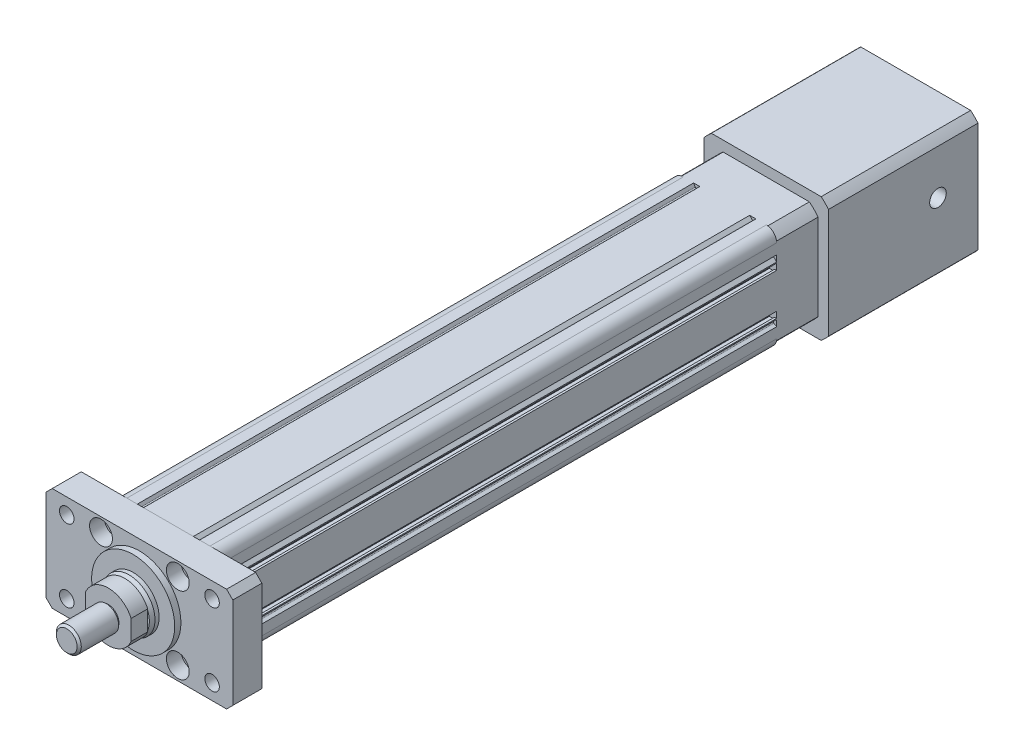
from build123d import *

# Parameters (mm, degrees)
SKETCH_1_R                  = 20
SKETCH_1_R_2                = 2.75
EXTRUDE_1_DEPTH             = 268
FILLET_1_R                  = 5
EXTRUDE_2_DEPTH             = 14
SKETCH_3_R                  = 20
EXTRUDE_3_DEPTH             = 3
SKETCH_5_R                  = 12.5
EXTRUDE_4_DEPTH             = 4
CHAMFER_1_SIZE              = 2
CHAMFER_1_SIZE2             = 0.7
EXTRUDE_5_DEPTH             = 8
SKETCH_7_R                  = 5.15
EXTRUDE_6_DEPTH             = 1
SKETCH_8_R                  = 6
EXTRUDE_7_DEPTH             = 19
CHAMFER_2_SIZE              = 1
SKETCH_23_W                 = 50
SKETCH_23_H                 = 50
EXTRUDE_8_DEPTH             = 20
SKETCH_24_R                 = 42.5
SKETCH_24_R_2               = 32.5
CUT_EXTRUDE_1_DEPTH         = 20
SKETCH_28_W                 = 60
SKETCH_28_H                 = 60
EXTRUDE_9_DEPTH             = 72
SKETCH_4_R                  = 3.5
CUT_EXTRUDE_5_DEPTH         = 30
SKETCH_4_6_R                = 5.5
CUT_EXTRUDE_6_DEPTH         = 7
CUT_EXTRUDE_START           = -72
SKETCH_30_R                 = 3.5
CUT_EXTRUDE_7_DEPTH         = 72
SKETCH_30_4_R               = 5.5
CUT_EXTRUDE_8_DEPTH         = 50
HOLE_WIZARD_M5_1_AT_2_COUNT = 2
HOLE_WIZARD_M5_1_AT_2_PITCH = 49.497474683
HOLE_WIZARD_M5_1_AT_3_COUNT = 2
HOLE_WIZARD_M5_1_AT_3_PITCH = 70
HOLE_WIZARD_M5_1_AT_4_COUNT = 2
HOLE_WIZARD_M5_1_AT_4_PITCH = 49.497474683
SKETCH_33_R                 = 19
CUT_EXTRUDE_9_DEPTH         = 65
SKETCH_33_3_R               = 25
CUT_EXTRUDE_10_DEPTH        = 6.5
SKETCH_34_R                 = 50
SKETCH_34_R_2               = 40
CUT_EXTRUDE_2_DEPTH         = 72
SKETCH_35_R                 = 4
CUT_EXTRUDE_11_DEPTH        = 22
SKETCH_36_R                 = 4
CUT_EXTRUDE_12_DEPTH        = 22


with BuildPart() as part:
    # Sketch 1 → Extrude 1 (new body)
    with BuildSketch(Plane.XY):
        with BuildLine():
            Line((-25, 25), (-15, 25))
            Line((-15, 25), (-14.227730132, 23.662389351))
            ThreePointArc((-14.227730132, 23.662389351), (-13.859980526, 23.416666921), (-13.441164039, 23.558835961))
            Line((-13.441164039, 23.558835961), (-12, 25))
            Line((-12, 25), (12, 25))
            Line((12, 25), (13.441164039, 23.558835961))
            ThreePointArc((13.441164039, 23.558835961), (13.859980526, 23.416666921), (14.227730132, 23.662389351))
            Line((14.227730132, 23.662389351), (15, 25))
            Line((15, 25), (25, 25))
            Line((25, 25), (25, 15))
            Line((25, 15), (23.662389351, 14.227730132))
            ThreePointArc((23.662389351, 14.227730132), (23.416666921, 13.859980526), (23.558835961, 13.441164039))
            Line((23.558835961, 13.441164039), (25, 12))
            Line((25, 12), (25, 11.5))
            Line((25, 11.5), (24, 11.5))
            Line((24, 11.5), (24, 12.4))
            Line((24, 12.4), (21.5, 12.4))
            Line((21.5, 12.4), (21.5, 7.6))
            Line((21.5, 7.6), (24, 7.6))
            Line((24, 7.6), (24, 8.5))
            Line((24, 8.5), (25, 8.5))
            Line((25, 8.5), (25, -8.5))
            Line((25, -8.5), (24, -8.5))
            Line((24, -8.5), (24, -7.6))
            Line((24, -7.6), (21.5, -7.6))
            Line((21.5, -7.6), (21.5, -12.4))
            Line((21.5, -12.4), (24, -12.4))
            Line((24, -12.4), (24, -11.5))
            Line((24, -11.5), (25, -11.5))
            Line((25, -11.5), (25, -12))
            Line((25, -12), (23.558835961, -13.441164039))
            ThreePointArc((23.558835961, -13.441164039), (23.416666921, -13.859980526), (23.662389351, -14.227730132))
            Line((23.662389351, -14.227730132), (25, -15))
            Line((25, -15), (25, -25))
            Line((25, -25), (15, -25))
            Line((15, -25), (14.227730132, -23.662389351))
            ThreePointArc((14.227730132, -23.662389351), (13.859980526, -23.416666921), (13.441164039, -23.558835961))
            Line((13.441164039, -23.558835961), (12, -25))
            Line((12, -25), (11.5, -25))
            Line((11.5, -25), (11.5, -24))
            Line((11.5, -24), (12.4, -24))
            Line((12.4, -24), (12.4, -21.5))
            Line((12.4, -21.5), (7.6, -21.5))
            Line((7.6, -21.5), (7.6, -24))
            Line((7.6, -24), (8.5, -24))
            Line((8.5, -24), (8.5, -25))
            Line((8.5, -25), (-8.5, -25))
            Line((-8.5, -25), (-8.5, -24))
            Line((-8.5, -24), (-7.6, -24))
            Line((-7.6, -24), (-7.6, -21.5))
            Line((-7.6, -21.5), (-12.4, -21.5))
            Line((-12.4, -21.5), (-12.4, -24))
            Line((-12.4, -24), (-11.5, -24))
            Line((-11.5, -24), (-11.5, -25))
            Line((-11.5, -25), (-12, -25))
            Line((-12, -25), (-13.441164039, -23.558835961))
            ThreePointArc((-13.441164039, -23.558835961), (-13.859980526, -23.416666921), (-14.227730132, -23.662389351))
            Line((-14.227730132, -23.662389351), (-15, -25))
            Line((-15, -25), (-25, -25))
            Line((-25, -25), (-25, -15))
            Line((-25, -15), (-23.662389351, -14.227730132))
            ThreePointArc((-23.662389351, -14.227730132), (-23.416666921, -13.859980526), (-23.558835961, -13.441164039))
            Line((-23.558835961, -13.441164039), (-25, -12))
            Line((-25, -12), (-25, -11.5))
            Line((-25, -11.5), (-24, -11.5))
            Line((-24, -11.5), (-24, -12.4))
            Line((-24, -12.4), (-21.5, -12.4))
            Line((-21.5, -12.4), (-21.5, -7.6))
            Line((-21.5, -7.6), (-24, -7.6))
            Line((-24, -7.6), (-24, -8.5))
            Line((-24, -8.5), (-25, -8.5))
            Line((-25, -8.5), (-25, 8.5))
            Line((-25, 8.5), (-24, 8.5))
            Line((-24, 8.5), (-24, 7.6))
            Line((-24, 7.6), (-21.5, 7.6))
            Line((-21.5, 7.6), (-21.5, 12.4))
            Line((-21.5, 12.4), (-24, 12.4))
            Line((-24, 12.4), (-24, 11.5))
            Line((-24, 11.5), (-25, 11.5))
            Line((-25, 11.5), (-25, 12))
            Line((-25, 12), (-23.558835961, 13.441164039))
            ThreePointArc((-23.558835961, 13.441164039), (-23.416666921, 13.859980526), (-23.662389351, 14.227730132))
            Line((-23.662389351, 14.227730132), (-25, 15))
            Line((-25, 15), (-25, 25))
        make_face()
        Circle(SKETCH_1_R, mode=Mode.SUBTRACT)
        with Locations((-18.5, 18.5)):
            Circle(SKETCH_1_R_2, mode=Mode.SUBTRACT)
        with Locations((18.5, 18.5)):
            Circle(SKETCH_1_R_2, mode=Mode.SUBTRACT)
        with Locations((18.5, -18.5)):
            Circle(SKETCH_1_R_2, mode=Mode.SUBTRACT)
        with Locations((-18.5, -18.5)):
            Circle(SKETCH_1_R_2, mode=Mode.SUBTRACT)
        with BuildLine():
            Line((-13.868836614, 23), (-5, 23))
            ThreePointArc((-5, 23), (-4.502985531, 22.554558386), (-4.891534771, 22.01190647))
            ThreePointArc((-4.891534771, 22.01190647), (-10.498377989, 19.955831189), (-15.368836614, 16.5))
            Line((-15.368836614, 16.5), (-15.368836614, 21.5))
            Line((-15.368836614, 21.5), (-13.868836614, 23))
        make_face(mode=Mode.SUBTRACT)
        with BuildLine():
            Line((15.368836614, 16.5), (15.368836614, 21.5))
            Line((15.368836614, 21.5), (13.868836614, 23))
            Line((13.868836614, 23), (5, 23))
            ThreePointArc((5, 23), (4.502985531, 22.554558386), (4.891534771, 22.01190647))
            ThreePointArc((4.891534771, 22.01190647), (10.498377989, 19.955831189), (15.368836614, 16.5))
        make_face(mode=Mode.SUBTRACT)
    extrude(amount=EXTRUDE_1_DEPTH)

    # Fillet 1
    fillet_1_edges = [part.edges().sort_by_distance(p)[0] for p in [
        (-25, 25, 134),
        (25, 25, 134),
        (25, -25, 134),
        (-25, -25, 134),
    ]]
    fillet(fillet_1_edges, radius=FILLET_1_R)

    # Sketch 23 → Extrude 8 (add)
    with BuildSketch(Plane(origin=(0, 0, 0), x_dir=(-1, 0, 0), z_dir=(0, 0, -1))):
        Rectangle(SKETCH_23_W, SKETCH_23_H)
    extrude(amount=EXTRUDE_8_DEPTH)

    # Sketch 24 → Cut-Extrude 1 (cut)
    with BuildSketch(Plane(origin=(0, 0, -20), x_dir=(-1, 0, 0), z_dir=(0, 0, -1))):
        Circle(SKETCH_24_R)
        Circle(SKETCH_24_R_2, mode=Mode.SUBTRACT)
    extrude(amount=-CUT_EXTRUDE_1_DEPTH, mode=Mode.SUBTRACT)

    # Sketch 27 → Hole Wizard M6 _1 (revolve, cut)
    with BuildSketch(Plane(origin=(0, -25, -12), x_dir=(0, 0, -1), z_dir=(1, 0, 0))):
        Polygon((0, 0), (0, 8.502151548), (2.5, 7), (2.5, 0), align=None)
    revolve(axis=Axis((0, -31.35, -12), (0, 1, 0)), mode=Mode.SUBTRACT)


with BuildPart() as body_2:
    # Sketch 2 → Extrude 2 (new body)
    with BuildSketch(Plane.XY.offset(268)):
        Polygon((-45, 22), (-42, 25), (42, 25), (45, 22), (45, -22), (42, -25), (-42, -25), (-45, -22), align=None)
    extrude(amount=EXTRUDE_2_DEPTH)


with BuildPart() as body_3:
    # Sketch 3 → Extrude 3 (new body)
    with BuildSketch(Plane.XY.offset(282)):
        Circle(SKETCH_3_R)
    extrude(amount=EXTRUDE_3_DEPTH)


with BuildPart() as body_4:
    # Sketch 5 → Extrude 4 (new body)
    with BuildSketch(Plane.XY.offset(285)):
        Circle(SKETCH_5_R)
    extrude(amount=EXTRUDE_4_DEPTH)

    # Chamfer 1
    chamfer_1_edges = [body_4.edges().sort_by_distance(p)[0] for p in [
        (-12.5, 0, 289),
    ]]
    chamfer_1_side = [body_4.faces().sort_by_distance(p)[0] for p in [
        (-12.5, 0, 287),
    ]]
    chamfer(chamfer_1_edges, length=CHAMFER_1_SIZE, length2=CHAMFER_1_SIZE2, reference=chamfer_1_side[0])


with BuildPart() as body_5:
    # Sketch 6 → Extrude 5 (new body)
    with BuildSketch(Plane.XY.offset(289)):
        with BuildLine():
            Line((-11, 4.795831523), (-11, -4.795831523))
            ThreePointArc((-11, -4.795831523), (0, -12), (11, -4.795831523))
            Line((11, -4.795831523), (11, 4.795831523))
            ThreePointArc((11, 4.795831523), (0, 12), (-11, 4.795831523))
        make_face()
    extrude(amount=EXTRUDE_5_DEPTH)


with BuildPart() as body_6:
    # Sketch 7 → Extrude 6 (new body)
    with BuildSketch(Plane.XY.offset(297)):
        Circle(SKETCH_7_R)
    extrude(amount=EXTRUDE_6_DEPTH)


with BuildPart() as body_7:
    # Sketch 8 → Extrude 7 (new body)
    with BuildSketch(Plane.XY.offset(298)):
        Circle(SKETCH_8_R)
    extrude(amount=EXTRUDE_7_DEPTH)

    # Chamfer 2
    chamfer_2_edges = [body_7.edges().sort_by_distance(p)[0] for p in [
        (-6, 0, 317),
    ]]
    chamfer(chamfer_2_edges, length=CHAMFER_2_SIZE)


with BuildPart() as body_8:
    # Sketch 28 → Extrude 9 (new body)
    with BuildSketch(Plane(origin=(0, 0, -20), x_dir=(-1, 0, 0), z_dir=(0, 0, -1))):
        Rectangle(SKETCH_28_W, SKETCH_28_H)
    extrude(amount=EXTRUDE_9_DEPTH)

    # Sketch 30 → Cut-Extrude 7 (cut)
    with BuildSketch(Plane(origin=(0, 0, -92), x_dir=(-1, 0, 0), z_dir=(0, 0, -1)).offset(CUT_EXTRUDE_START)):
        with Locations((-16.099900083, 18.5)):
            Circle(SKETCH_30_R)
        with Locations((19.700049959, 17.299950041)):
            Circle(SKETCH_30_R)
        with Locations((18.5, -18.5)):
            Circle(SKETCH_30_R)
        with Locations((-17.299950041, -17.299950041)):
            Circle(SKETCH_30_R)
    extrude(amount=CUT_EXTRUDE_7_DEPTH, mode=Mode.SUBTRACT)

    # Sketch 30_4 → Cut-Extrude 8 (cut)
    with BuildSketch(Plane(origin=(0, 0, -92), x_dir=(-1, 0, 0), z_dir=(0, 0, -1))):
        with Locations((18.5, -18.5)):
            Circle(SKETCH_30_4_R)
        with Locations((-17.299950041, -17.299950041)):
            Circle(SKETCH_30_4_R)
        with Locations((-16.099900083, 18.5)):
            Circle(SKETCH_30_4_R)
        with Locations((19.700049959, 17.299950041)):
            Circle(SKETCH_30_4_R)
    extrude(amount=-CUT_EXTRUDE_8_DEPTH, mode=Mode.SUBTRACT)

    # Sketch 32 → Hole Wizard M5 _1 (revolve, cut)
    with BuildSketch(Plane(origin=(-24.748737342, -24.748737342, -92), x_dir=(0, 1, 0), z_dir=(1, 0, 0))):
        Polygon((0, 0), (0, 15.2618073), (2.1, 14), (2.1, 0), align=None)
    hole_wizard_m5_1 = revolve(axis=Axis((-24.748737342, -24.748737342, -98.35), (0, 0, 1)), mode=Mode.SUBTRACT)

    # Hole Wizard M5 _1 at 2: Hole Wizard M5 _1 ×2
    with Locations(*[(i * HOLE_WIZARD_M5_1_AT_2_PITCH, 0, 0) for i in range(1, HOLE_WIZARD_M5_1_AT_2_COUNT)]):
        add(hole_wizard_m5_1, mode=Mode.SUBTRACT)

    # Hole Wizard M5 _1 at 3: Hole Wizard M5 _1 ×2
    with Locations(*[Vector(0.7071067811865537, 0.7071067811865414, 0) * (i * HOLE_WIZARD_M5_1_AT_3_PITCH) for i in range(1, HOLE_WIZARD_M5_1_AT_3_COUNT)]):
        add(hole_wizard_m5_1, mode=Mode.SUBTRACT)

    # Hole Wizard M5 _1 at 4: Hole Wizard M5 _1 ×2
    with Locations(*[(0, i * HOLE_WIZARD_M5_1_AT_4_PITCH, 0) for i in range(1, HOLE_WIZARD_M5_1_AT_4_COUNT)]):
        add(hole_wizard_m5_1, mode=Mode.SUBTRACT)

    # Sketch 33 → Cut-Extrude 9 (cut)
    with BuildSketch(Plane(origin=(0, 0, -92), x_dir=(-1, 0, 0), z_dir=(0, 0, -1))):
        Circle(SKETCH_33_R)
    extrude(amount=-CUT_EXTRUDE_9_DEPTH, mode=Mode.SUBTRACT)

    # Sketch 33_3 → Cut-Extrude 10 (cut)
    with BuildSketch(Plane(origin=(0, 0, -92), x_dir=(-1, 0, 0), z_dir=(0, 0, -1))):
        Circle(SKETCH_33_3_R)
    extrude(amount=-CUT_EXTRUDE_10_DEPTH, mode=Mode.SUBTRACT)

    # Sketch 34 → Cut-Extrude 2 (cut)
    with BuildSketch(Plane(origin=(0, 0, -92), x_dir=(-1, 0, 0), z_dir=(0, 0, -1))):
        Circle(SKETCH_34_R)
        Circle(SKETCH_34_R_2, mode=Mode.SUBTRACT)
    extrude(amount=-CUT_EXTRUDE_2_DEPTH, mode=Mode.SUBTRACT)

    # Sketch 35 → Cut-Extrude 11 (cut)
    with BuildSketch(Plane(origin=(30, 0, 0), x_dir=(0, 0, -1), z_dir=(1, 0, 0))):
        with Locations((72.713697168, 4.902306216)):
            Circle(SKETCH_35_R)
    extrude(amount=-CUT_EXTRUDE_11_DEPTH, mode=Mode.SUBTRACT)

    # Sketch 36 → Cut-Extrude 12 (cut)
    with BuildSketch(Plane.ZY.offset(30)):
        with Locations((-37.731412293, -10.555978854)):
            Circle(SKETCH_36_R)
    extrude(amount=-CUT_EXTRUDE_12_DEPTH, mode=Mode.SUBTRACT)


with BuildPart() as cut_extrude_5_tool:
    # Sketch 4 → Cut-Extrude 5 (new body)
    with BuildSketch(Plane.XY.offset(282)):
        with Locations((-35, 17.5)):
            Circle(SKETCH_4_R)
        with Locations((-18.5, 18.5)):
            Circle(SKETCH_4_R)
        with Locations(Location((-18.5, -18.5, 0), (0, 0, 180))):
            Circle(SKETCH_4_R)
        with Locations(Location((-35, -17.5, 0), (0, 0, 180))):
            Circle(SKETCH_4_R)
        with Locations((35, -17.5)):
            Circle(SKETCH_4_R)
        with Locations((18.5, -18.5)):
            Circle(SKETCH_4_R)
        with Locations(Location((18.5, 18.5, 0), (0, 0, 180))):
            Circle(SKETCH_4_R)
        with Locations(Location((35, 17.5, 0), (0, 0, 180))):
            Circle(SKETCH_4_R)
    extrude(amount=-CUT_EXTRUDE_5_DEPTH)


with BuildPart() as part_1:
    add(part.part)

    # Cut-Extrude 5: cut by cut_extrude_5_tool
    add(cut_extrude_5_tool.part, mode=Mode.SUBTRACT)


with BuildPart() as body_2_1:
    add(body_2.part)

    # Cut-Extrude 5: cut by cut_extrude_5_tool
    add(cut_extrude_5_tool.part, mode=Mode.SUBTRACT)

    # Sketch 4_6 → Cut-Extrude 6 (cut)
    with BuildSketch(Plane.XY.offset(282)):
        with Locations((-18.5, 18.5)):
            Circle(SKETCH_4_6_R)
        with Locations(Location((-18.5, -18.5, 0), (0, 0, 180))):
            Circle(SKETCH_4_6_R)
        with Locations((18.5, -18.5)):
            Circle(SKETCH_4_6_R)
        with Locations(Location((18.5, 18.5, 0), (0, 0, 180))):
            Circle(SKETCH_4_6_R)
    extrude(amount=-CUT_EXTRUDE_6_DEPTH, mode=Mode.SUBTRACT)


solid = Compound([body_3.part, body_4.part, body_5.part, body_6.part, body_7.part, body_8.part, part_1.part, body_2_1.part])
